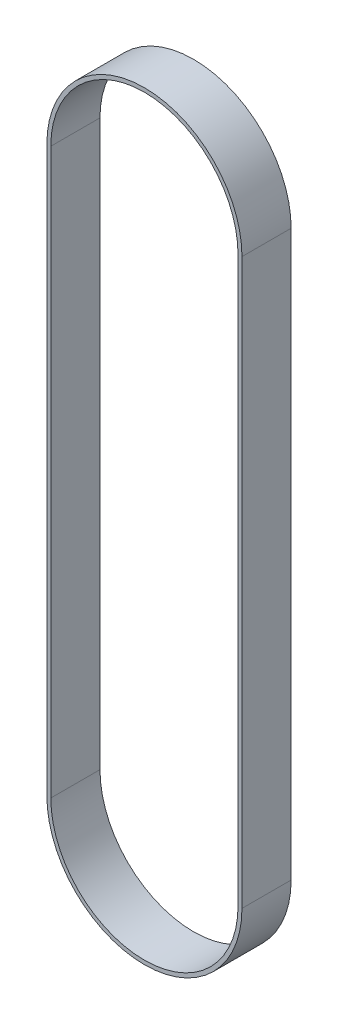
from build123d import *

# Parameters (mm, degrees)
EXTRUDE1_DEPTH = 31.75


with BuildPart() as part:
    # Sketch1 → Extrude1 (new body)
    with BuildSketch(Plane.XY):
        with BuildLine():
            Line((-62.992, 0), (-62.992, -364.49))
            ThreePointArc((-62.992, -364.49), (0, -427.482), (62.992, -364.49))
            Line((62.992, -364.49), (62.992, 0))
            ThreePointArc((62.992, 0), (0, 62.992), (-62.992, 0))
        make_face()
        with BuildLine():
            Line((-60.452, 0), (-60.452, -364.49))
            ThreePointArc((-60.452, -364.49), (0, -424.942), (60.452, -364.49))
            Line((60.452, -364.49), (60.452, 0))
            ThreePointArc((60.452, 0), (0, 60.452), (-60.452, 0))
        make_face(mode=Mode.SUBTRACT)
    extrude(amount=EXTRUDE1_DEPTH)


solid = part.part
